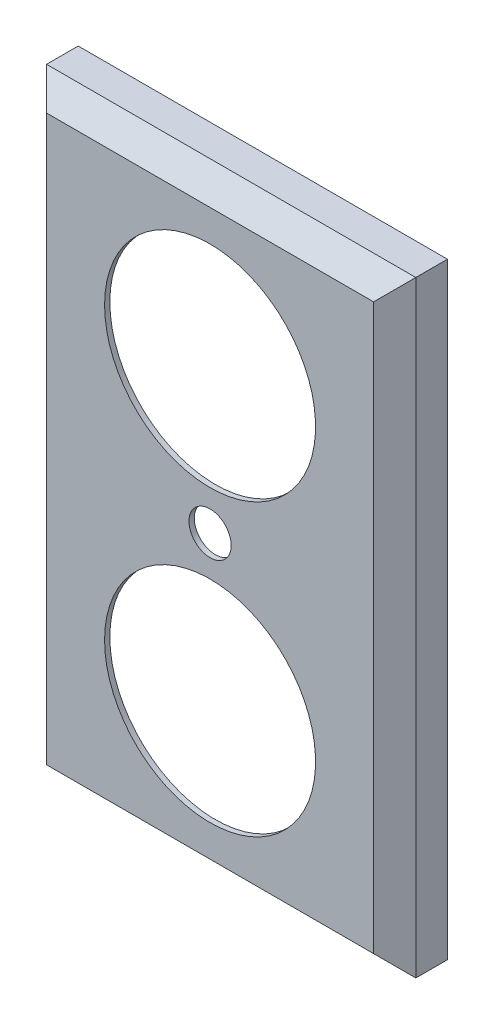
ISO-10303-21;
HEADER;
FILE_DESCRIPTION(('STEP AP214'),'2;1');
FILE_NAME('part.step','',(''),(''),'','','');
FILE_SCHEMA(('AUTOMOTIVE_DESIGN { 1 0 10303 214 1 1 1 1 }'));
ENDSEC;
DATA;
#1=APPLICATION_CONTEXT('core data for automotive mechanical design processes');
#2=APPLICATION_PROTOCOL_DEFINITION('international standard','automotive_design',2000,#1);
#3=PRODUCT_CONTEXT('',#1,'mechanical');
#4=PRODUCT('Part','Part','',(#3));
#5=PRODUCT_RELATED_PRODUCT_CATEGORY('part','',(#4));
#6=PRODUCT_DEFINITION_FORMATION('','',#4);
#7=PRODUCT_DEFINITION_CONTEXT('part definition',#1,'design');
#8=PRODUCT_DEFINITION('design','',#6,#7);
#9=PRODUCT_DEFINITION_SHAPE('','',#8);
#10=(LENGTH_UNIT() NAMED_UNIT(*) SI_UNIT(.MILLI.,.METRE.));
#11=(NAMED_UNIT(*) PLANE_ANGLE_UNIT() SI_UNIT($,.RADIAN.));
#12=(NAMED_UNIT(*) SI_UNIT($,.STERADIAN.) SOLID_ANGLE_UNIT());
#13=UNCERTAINTY_MEASURE_WITH_UNIT(LENGTH_MEASURE(1.E-05),#10,'distance_accuracy_value','');
#14=(GEOMETRIC_REPRESENTATION_CONTEXT(3) GLOBAL_UNCERTAINTY_ASSIGNED_CONTEXT((#13)) GLOBAL_UNIT_ASSIGNED_CONTEXT((#10,
#11,#12)) REPRESENTATION_CONTEXT('',''));
#15=CARTESIAN_POINT('',(0.,0.,0.));
#16=DIRECTION('',(0.,0.,1.));
#17=DIRECTION('',(1.,0.,0.));
#18=AXIS2_PLACEMENT_3D('',#15,#16,#17);
#19=CARTESIAN_POINT('',(0.,115.,0.));
#20=DIRECTION('',(0.,0.,-1.));
#21=DIRECTION('',(-1.,0.,0.));
#22=AXIS2_PLACEMENT_3D('',#19,#20,#21);
#23=PLANE('',#22);
#24=DIRECTION('',(0.,-1.,0.));
#25=VECTOR('',#24,1.);
#26=CARTESIAN_POINT('',(0.,0.,0.));
#27=LINE('',#26,#25);
#28=CARTESIAN_POINT('',(0.,115.,0.));
#29=VERTEX_POINT('',#28);
#30=CARTESIAN_POINT('',(0.,0.,0.));
#31=VERTEX_POINT('',#30);
#32=EDGE_CURVE('E176',#29,#31,#27,.T.);
#33=ORIENTED_EDGE('',*,*,#32,.F.);
#34=DIRECTION('',(-1.,0.,0.));
#35=VECTOR('',#34,1.);
#36=CARTESIAN_POINT('',(0.,115.,0.));
#37=LINE('',#36,#35);
#38=CARTESIAN_POINT('',(70.,115.,0.));
#39=VERTEX_POINT('',#38);
#40=EDGE_CURVE('E186',#39,#29,#37,.T.);
#41=ORIENTED_EDGE('',*,*,#40,.F.);
#42=DIRECTION('',(0.,1.,0.));
#43=VECTOR('',#42,1.);
#44=CARTESIAN_POINT('',(70.,0.,0.));
#45=LINE('',#44,#43);
#46=CARTESIAN_POINT('',(70.,0.,0.));
#47=VERTEX_POINT('',#46);
#48=EDGE_CURVE('E183',#47,#39,#45,.T.);
#49=ORIENTED_EDGE('',*,*,#48,.F.);
#50=DIRECTION('',(1.,0.,0.));
#51=VECTOR('',#50,1.);
#52=CARTESIAN_POINT('',(0.,0.,0.));
#53=LINE('',#52,#51);
#54=EDGE_CURVE('E179',#31,#47,#53,.T.);
#55=ORIENTED_EDGE('',*,*,#54,.F.);
#56=EDGE_LOOP('',(#33,#41,#49,#55));
#57=FACE_BOUND('',#56,.T.);
#58=DIRECTION('',(-1.,0.,0.));
#59=VECTOR('',#58,1.);
#60=CARTESIAN_POINT('',(0.,114.,0.));
#61=LINE('',#60,#59);
#62=CARTESIAN_POINT('',(69.,114.,0.));
#63=VERTEX_POINT('',#62);
#64=CARTESIAN_POINT('',(1.,114.,0.));
#65=VERTEX_POINT('',#64);
#66=EDGE_CURVE('E145',#63,#65,#61,.T.);
#67=ORIENTED_EDGE('',*,*,#66,.T.);
#68=DIRECTION('',(0.,-1.,0.));
#69=VECTOR('',#68,1.);
#70=CARTESIAN_POINT('',(1.,115.,0.));
#71=LINE('',#70,#69);
#72=CARTESIAN_POINT('',(1.,1.,0.));
#73=VERTEX_POINT('',#72);
#74=EDGE_CURVE('E140',#65,#73,#71,.T.);
#75=ORIENTED_EDGE('',*,*,#74,.T.);
#76=DIRECTION('',(1.,0.,0.));
#77=VECTOR('',#76,1.);
#78=CARTESIAN_POINT('',(0.,1.,0.));
#79=LINE('',#78,#77);
#80=CARTESIAN_POINT('',(69.,1.,0.));
#81=VERTEX_POINT('',#80);
#82=EDGE_CURVE('E170',#73,#81,#79,.T.);
#83=ORIENTED_EDGE('',*,*,#82,.T.);
#84=DIRECTION('',(0.,1.,0.));
#85=VECTOR('',#84,1.);
#86=CARTESIAN_POINT('',(69.,115.,0.));
#87=LINE('',#86,#85);
#88=EDGE_CURVE('E49',#81,#63,#87,.T.);
#89=ORIENTED_EDGE('',*,*,#88,.T.);
#90=EDGE_LOOP('',(#67,#75,#83,#89));
#91=FACE_BOUND('',#90,.T.);
#92=ADVANCED_FACE('F32',(#57,#91),#23,.T.);
#93=CARTESIAN_POINT('',(0.,0.,10.));
#94=DIRECTION('',(1.,0.,0.));
#95=DIRECTION('',(0.,0.,-1.));
#96=AXIS2_PLACEMENT_3D('',#93,#94,#95);
#97=PLANE('',#96);
#98=DIRECTION('',(0.,0.,-1.));
#99=VECTOR('',#98,1.);
#100=CARTESIAN_POINT('',(0.,0.,10.));
#101=LINE('',#100,#99);
#102=CARTESIAN_POINT('',(0.,0.,5.99999999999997));
#103=VERTEX_POINT('',#102);
#104=EDGE_CURVE('E195',#103,#31,#101,.T.);
#105=ORIENTED_EDGE('',*,*,#104,.F.);
#106=DIRECTION('',(0.,1.,0.));
#107=VECTOR('',#106,1.);
#108=CARTESIAN_POINT('',(0.,0.,5.99999999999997));
#109=LINE('',#108,#107);
#110=CARTESIAN_POINT('',(0.,115.,5.99999999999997));
#111=VERTEX_POINT('',#110);
#112=EDGE_CURVE('E11',#103,#111,#109,.T.);
#113=ORIENTED_EDGE('',*,*,#112,.T.);
#114=DIRECTION('',(0.,0.,-1.));
#115=VECTOR('',#114,1.);
#116=CARTESIAN_POINT('',(0.,115.,10.));
#117=LINE('',#116,#115);
#118=EDGE_CURVE('E189',#111,#29,#117,.T.);
#119=ORIENTED_EDGE('',*,*,#118,.T.);
#120=ORIENTED_EDGE('',*,*,#32,.T.);
#121=EDGE_LOOP('',(#105,#113,#119,#120));
#122=FACE_BOUND('',#121,.T.);
#123=ADVANCED_FACE('F271',(#122),#97,.F.);
#124=CARTESIAN_POINT('',(0.,0.,10.));
#125=DIRECTION('',(0.,1.,0.));
#126=DIRECTION('',(0.,0.,1.));
#127=AXIS2_PLACEMENT_3D('',#124,#125,#126);
#128=PLANE('',#127);
#129=DIRECTION('',(0.,0.,-1.));
#130=VECTOR('',#129,1.);
#131=CARTESIAN_POINT('',(70.,0.,10.));
#132=LINE('',#131,#130);
#133=CARTESIAN_POINT('',(70.,0.,5.99999999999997));
#134=VERTEX_POINT('',#133);
#135=EDGE_CURVE('E193',#134,#47,#132,.T.);
#136=ORIENTED_EDGE('',*,*,#135,.F.);
#137=DIRECTION('',(-1.,0.,0.));
#138=VECTOR('',#137,1.);
#139=CARTESIAN_POINT('',(0.,0.,5.99999999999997));
#140=LINE('',#139,#138);
#141=EDGE_CURVE('E41',#134,#103,#140,.T.);
#142=ORIENTED_EDGE('',*,*,#141,.T.);
#143=ORIENTED_EDGE('',*,*,#104,.T.);
#144=ORIENTED_EDGE('',*,*,#54,.T.);
#145=EDGE_LOOP('',(#136,#142,#143,#144));
#146=FACE_BOUND('',#145,.T.);
#147=ADVANCED_FACE('F277',(#146),#128,.F.);
#148=CARTESIAN_POINT('',(70.,0.,10.));
#149=DIRECTION('',(-1.,0.,0.));
#150=DIRECTION('',(0.,0.,1.));
#151=AXIS2_PLACEMENT_3D('',#148,#149,#150);
#152=PLANE('',#151);
#153=DIRECTION('',(0.,0.,-1.));
#154=VECTOR('',#153,1.);
#155=CARTESIAN_POINT('',(70.,115.,10.));
#156=LINE('',#155,#154);
#157=CARTESIAN_POINT('',(70.,115.,5.99999999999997));
#158=VERTEX_POINT('',#157);
#159=EDGE_CURVE('E191',#158,#39,#156,.T.);
#160=ORIENTED_EDGE('',*,*,#159,.F.);
#161=DIRECTION('',(0.,-1.,0.));
#162=VECTOR('',#161,1.);
#163=CARTESIAN_POINT('',(70.,0.,5.99999999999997));
#164=LINE('',#163,#162);
#165=EDGE_CURVE('E209',#158,#134,#164,.T.);
#166=ORIENTED_EDGE('',*,*,#165,.T.);
#167=ORIENTED_EDGE('',*,*,#135,.T.);
#168=ORIENTED_EDGE('',*,*,#48,.T.);
#169=EDGE_LOOP('',(#160,#166,#167,#168));
#170=FACE_BOUND('',#169,.T.);
#171=ADVANCED_FACE('F289',(#170),#152,.F.);
#172=CARTESIAN_POINT('',(0.,115.,10.));
#173=DIRECTION('',(0.,-1.,0.));
#174=DIRECTION('',(0.,0.,-1.));
#175=AXIS2_PLACEMENT_3D('',#172,#173,#174);
#176=PLANE('',#175);
#177=ORIENTED_EDGE('',*,*,#118,.F.);
#178=DIRECTION('',(1.,0.,0.));
#179=VECTOR('',#178,1.);
#180=CARTESIAN_POINT('',(0.,115.,5.99999999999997));
#181=LINE('',#180,#179);
#182=EDGE_CURVE('E206',#111,#158,#181,.T.);
#183=ORIENTED_EDGE('',*,*,#182,.T.);
#184=ORIENTED_EDGE('',*,*,#159,.T.);
#185=ORIENTED_EDGE('',*,*,#40,.T.);
#186=EDGE_LOOP('',(#177,#183,#184,#185));
#187=FACE_BOUND('',#186,.T.);
#188=ADVANCED_FACE('F286',(#187),#176,.F.);
#189=CARTESIAN_POINT('',(0.,115.,10.));
#190=DIRECTION('',(0.,0.,-1.));
#191=DIRECTION('',(-1.,0.,0.));
#192=AXIS2_PLACEMENT_3D('',#189,#190,#191);
#193=PLANE('',#192);
#194=CARTESIAN_POINT('',(35.,57.5,10.));
#195=DIRECTION('',(0.,0.,1.));
#196=DIRECTION('',(1.,0.,0.));
#197=AXIS2_PLACEMENT_3D('',#194,#195,#196);
#198=CIRCLE('',#197,4.00000000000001);
#199=CARTESIAN_POINT('',(39.,57.5,10.));
#200=VERTEX_POINT('',#199);
#201=EDGE_CURVE('E231',#200,#200,#198,.T.);
#202=ORIENTED_EDGE('',*,*,#201,.F.);
#203=EDGE_LOOP('',(#202));
#204=FACE_BOUND('',#203,.T.);
#205=CARTESIAN_POINT('',(35.,30.,10.));
#206=DIRECTION('',(0.,0.,-1.));
#207=DIRECTION('',(-1.,0.,0.));
#208=AXIS2_PLACEMENT_3D('',#205,#206,#207);
#209=CIRCLE('',#208,20.);
#210=CARTESIAN_POINT('',(15.,30.,10.));
#211=VERTEX_POINT('',#210);
#212=EDGE_CURVE('E221',#211,#211,#209,.T.);
#213=ORIENTED_EDGE('',*,*,#212,.T.);
#214=EDGE_LOOP('',(#213));
#215=FACE_BOUND('',#214,.T.);
#216=CARTESIAN_POINT('',(35.,85.,10.));
#217=DIRECTION('',(0.,0.,-1.));
#218=DIRECTION('',(-1.,0.,0.));
#219=AXIS2_PLACEMENT_3D('',#216,#217,#218);
#220=CIRCLE('',#219,20.);
#221=CARTESIAN_POINT('',(15.,85.,10.));
#222=VERTEX_POINT('',#221);
#223=EDGE_CURVE('E164',#222,#222,#220,.T.);
#224=ORIENTED_EDGE('',*,*,#223,.T.);
#225=EDGE_LOOP('',(#224));
#226=FACE_BOUND('',#225,.T.);
#227=DIRECTION('',(0.,1.,0.));
#228=VECTOR('',#227,1.);
#229=CARTESIAN_POINT('',(65.9999999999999,115.,10.));
#230=LINE('',#229,#228);
#231=CARTESIAN_POINT('',(65.9999999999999,4.00000000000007,10.));
#232=VERTEX_POINT('',#231);
#233=CARTESIAN_POINT('',(65.9999999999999,111.,10.));
#234=VERTEX_POINT('',#233);
#235=EDGE_CURVE('E201',#232,#234,#230,.T.);
#236=ORIENTED_EDGE('',*,*,#235,.T.);
#237=DIRECTION('',(-1.,0.,0.));
#238=VECTOR('',#237,1.);
#239=CARTESIAN_POINT('',(0.,111.,10.));
#240=LINE('',#239,#238);
#241=CARTESIAN_POINT('',(4.00000000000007,111.,10.));
#242=VERTEX_POINT('',#241);
#243=EDGE_CURVE('E203',#234,#242,#240,.T.);
#244=ORIENTED_EDGE('',*,*,#243,.T.);
#245=DIRECTION('',(0.,-1.,0.));
#246=VECTOR('',#245,1.);
#247=CARTESIAN_POINT('',(4.00000000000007,115.,10.));
#248=LINE('',#247,#246);
#249=CARTESIAN_POINT('',(4.00000000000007,4.00000000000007,10.));
#250=VERTEX_POINT('',#249);
#251=EDGE_CURVE('E197',#242,#250,#248,.T.);
#252=ORIENTED_EDGE('',*,*,#251,.T.);
#253=DIRECTION('',(1.,0.,0.));
#254=VECTOR('',#253,1.);
#255=CARTESIAN_POINT('',(0.,4.00000000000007,10.));
#256=LINE('',#255,#254);
#257=EDGE_CURVE('E199',#250,#232,#256,.T.);
#258=ORIENTED_EDGE('',*,*,#257,.T.);
#259=EDGE_LOOP('',(#236,#244,#252,#258));
#260=FACE_BOUND('',#259,.T.);
#261=ADVANCED_FACE('F284',(#204,#215,#226,#260),#193,.F.);
#262=CARTESIAN_POINT('',(0.,4.00000000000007,10.));
#263=DIRECTION('',(0.,0.707106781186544,-0.707106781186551));
#264=DIRECTION('',(0.,0.707106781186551,0.707106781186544));
#265=AXIS2_PLACEMENT_3D('',#262,#263,#264);
#266=PLANE('',#265);
#267=DIRECTION('',(0.577350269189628,0.577350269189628,0.577350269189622));
#268=VECTOR('',#267,1.);
#269=CARTESIAN_POINT('',(41.0000000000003,41.0000000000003,46.9999999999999));
#270=LINE('',#269,#268);
#271=EDGE_CURVE('E215',#103,#250,#270,.T.);
#272=ORIENTED_EDGE('',*,*,#271,.F.);
#273=ORIENTED_EDGE('',*,*,#141,.F.);
#274=DIRECTION('',(-0.577350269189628,0.577350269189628,0.577350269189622));
#275=VECTOR('',#274,1.);
#276=CARTESIAN_POINT('',(43.9999999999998,26.0000000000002,31.9999999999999));
#277=LINE('',#276,#275);
#278=EDGE_CURVE('E180',#232,#134,#277,.F.);
#279=ORIENTED_EDGE('',*,*,#278,.F.);
#280=ORIENTED_EDGE('',*,*,#257,.F.);
#281=EDGE_LOOP('',(#272,#273,#279,#280));
#282=FACE_BOUND('',#281,.T.);
#283=ADVANCED_FACE('F34',(#282),#266,.F.);
#284=CARTESIAN_POINT('',(65.9999999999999,115.,10.));
#285=DIRECTION('',(-0.707106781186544,0.,-0.707106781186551));
#286=DIRECTION('',(-0.707106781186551,0.,0.707106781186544));
#287=AXIS2_PLACEMENT_3D('',#284,#285,#286);
#288=PLANE('',#287);
#289=ORIENTED_EDGE('',*,*,#278,.T.);
#290=ORIENTED_EDGE('',*,*,#165,.F.);
#291=DIRECTION('',(-0.577350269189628,-0.577350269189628,0.577350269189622));
#292=VECTOR('',#291,1.);
#293=CARTESIAN_POINT('',(67.3333333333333,112.333333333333,8.66666666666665));
#294=LINE('',#293,#292);
#295=EDGE_CURVE('E213',#234,#158,#294,.F.);
#296=ORIENTED_EDGE('',*,*,#295,.F.);
#297=ORIENTED_EDGE('',*,*,#235,.F.);
#298=EDGE_LOOP('',(#289,#290,#296,#297));
#299=FACE_BOUND('',#298,.T.);
#300=ADVANCED_FACE('F302',(#299),#288,.F.);
#301=CARTESIAN_POINT('',(4.00000000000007,115.,10.));
#302=DIRECTION('',(0.707106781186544,0.,-0.707106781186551));
#303=DIRECTION('',(-0.707106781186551,0.,-0.707106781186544));
#304=AXIS2_PLACEMENT_3D('',#301,#302,#303);
#305=PLANE('',#304);
#306=ORIENTED_EDGE('',*,*,#271,.T.);
#307=ORIENTED_EDGE('',*,*,#251,.F.);
#308=DIRECTION('',(-0.577350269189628,0.577350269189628,-0.577350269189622));
#309=VECTOR('',#308,1.);
#310=CARTESIAN_POINT('',(2.6666666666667,112.333333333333,8.66666666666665));
#311=LINE('',#310,#309);
#312=EDGE_CURVE('E132',#111,#242,#311,.F.);
#313=ORIENTED_EDGE('',*,*,#312,.F.);
#314=ORIENTED_EDGE('',*,*,#112,.F.);
#315=EDGE_LOOP('',(#306,#307,#313,#314));
#316=FACE_BOUND('',#315,.T.);
#317=ADVANCED_FACE('F299',(#316),#305,.F.);
#318=CARTESIAN_POINT('',(0.,111.,10.));
#319=DIRECTION('',(0.,-0.707106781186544,-0.707106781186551));
#320=DIRECTION('',(0.,0.707106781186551,-0.707106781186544));
#321=AXIS2_PLACEMENT_3D('',#318,#319,#320);
#322=PLANE('',#321);
#323=ORIENTED_EDGE('',*,*,#295,.T.);
#324=ORIENTED_EDGE('',*,*,#182,.F.);
#325=ORIENTED_EDGE('',*,*,#312,.T.);
#326=ORIENTED_EDGE('',*,*,#243,.F.);
#327=EDGE_LOOP('',(#323,#324,#325,#326));
#328=FACE_BOUND('',#327,.T.);
#329=ADVANCED_FACE('F296',(#328),#322,.F.);
#330=CARTESIAN_POINT('',(1.,0.,10.));
#331=DIRECTION('',(1.,0.,0.));
#332=DIRECTION('',(0.,0.,-1.));
#333=AXIS2_PLACEMENT_3D('',#330,#331,#332);
#334=PLANE('',#333);
#335=DIRECTION('',(0.,0.,-1.));
#336=VECTOR('',#335,1.);
#337=CARTESIAN_POINT('',(1.,1.,10.));
#338=LINE('',#337,#336);
#339=CARTESIAN_POINT('',(0.999999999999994,1.,5.58578643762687));
#340=VERTEX_POINT('',#339);
#341=EDGE_CURVE('E234',#340,#73,#338,.T.);
#342=ORIENTED_EDGE('',*,*,#341,.T.);
#343=ORIENTED_EDGE('',*,*,#74,.F.);
#344=DIRECTION('',(0.,0.,-1.));
#345=VECTOR('',#344,1.);
#346=CARTESIAN_POINT('',(1.,114.,10.));
#347=LINE('',#346,#345);
#348=CARTESIAN_POINT('',(1.,114.,5.58578643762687));
#349=VERTEX_POINT('',#348);
#350=EDGE_CURVE('E136',#349,#65,#347,.T.);
#351=ORIENTED_EDGE('',*,*,#350,.F.);
#352=DIRECTION('',(0.,-1.,0.));
#353=VECTOR('',#352,1.);
#354=CARTESIAN_POINT('',(1.,115.,5.58578643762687));
#355=LINE('',#354,#353);
#356=EDGE_CURVE('E123',#340,#349,#355,.F.);
#357=ORIENTED_EDGE('',*,*,#356,.F.);
#358=EDGE_LOOP('',(#342,#343,#351,#357));
#359=FACE_BOUND('',#358,.T.);
#360=ADVANCED_FACE('F138',(#359),#334,.T.);
#361=CARTESIAN_POINT('',(0.,1.,10.));
#362=DIRECTION('',(0.,1.,0.));
#363=DIRECTION('',(0.,0.,1.));
#364=AXIS2_PLACEMENT_3D('',#361,#362,#363);
#365=PLANE('',#364);
#366=DIRECTION('',(0.,0.,-1.));
#367=VECTOR('',#366,1.);
#368=CARTESIAN_POINT('',(69.,1.,10.));
#369=LINE('',#368,#367);
#370=CARTESIAN_POINT('',(69.,0.999999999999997,5.58578643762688));
#371=VERTEX_POINT('',#370);
#372=EDGE_CURVE('E236',#371,#81,#369,.T.);
#373=ORIENTED_EDGE('',*,*,#372,.T.);
#374=ORIENTED_EDGE('',*,*,#82,.F.);
#375=ORIENTED_EDGE('',*,*,#341,.F.);
#376=DIRECTION('',(1.,0.,0.));
#377=VECTOR('',#376,1.);
#378=CARTESIAN_POINT('',(0.,1.,5.58578643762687));
#379=LINE('',#378,#377);
#380=EDGE_CURVE('E133',#371,#340,#379,.F.);
#381=ORIENTED_EDGE('',*,*,#380,.F.);
#382=EDGE_LOOP('',(#373,#374,#375,#381));
#383=FACE_BOUND('',#382,.T.);
#384=ADVANCED_FACE('F349',(#383),#365,.T.);
#385=CARTESIAN_POINT('',(69.,0.,10.));
#386=DIRECTION('',(-1.,0.,0.));
#387=DIRECTION('',(0.,0.,1.));
#388=AXIS2_PLACEMENT_3D('',#385,#386,#387);
#389=PLANE('',#388);
#390=DIRECTION('',(0.,0.,-1.));
#391=VECTOR('',#390,1.);
#392=CARTESIAN_POINT('',(69.,114.,10.));
#393=LINE('',#392,#391);
#394=CARTESIAN_POINT('',(69.,114.,5.58578643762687));
#395=VERTEX_POINT('',#394);
#396=EDGE_CURVE('E144',#395,#63,#393,.T.);
#397=ORIENTED_EDGE('',*,*,#396,.T.);
#398=ORIENTED_EDGE('',*,*,#88,.F.);
#399=ORIENTED_EDGE('',*,*,#372,.F.);
#400=DIRECTION('',(0.,1.,0.));
#401=VECTOR('',#400,1.);
#402=CARTESIAN_POINT('',(69.,115.,5.58578643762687));
#403=LINE('',#402,#401);
#404=EDGE_CURVE('E153',#395,#371,#403,.F.);
#405=ORIENTED_EDGE('',*,*,#404,.F.);
#406=EDGE_LOOP('',(#397,#398,#399,#405));
#407=FACE_BOUND('',#406,.T.);
#408=ADVANCED_FACE('F266',(#407),#389,.T.);
#409=CARTESIAN_POINT('',(0.,114.,10.));
#410=DIRECTION('',(0.,-1.,0.));
#411=DIRECTION('',(0.,0.,-1.));
#412=AXIS2_PLACEMENT_3D('',#409,#410,#411);
#413=PLANE('',#412);
#414=ORIENTED_EDGE('',*,*,#350,.T.);
#415=ORIENTED_EDGE('',*,*,#66,.F.);
#416=ORIENTED_EDGE('',*,*,#396,.F.);
#417=DIRECTION('',(-1.,0.,0.));
#418=VECTOR('',#417,1.);
#419=CARTESIAN_POINT('',(0.,114.,5.58578643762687));
#420=LINE('',#419,#418);
#421=EDGE_CURVE('E149',#349,#395,#420,.F.);
#422=ORIENTED_EDGE('',*,*,#421,.F.);
#423=EDGE_LOOP('',(#414,#415,#416,#422));
#424=FACE_BOUND('',#423,.T.);
#425=ADVANCED_FACE('F150',(#424),#413,.T.);
#426=CARTESIAN_POINT('',(0.,115.,9.));
#427=DIRECTION('',(0.,0.,-1.));
#428=DIRECTION('',(-1.,0.,0.));
#429=AXIS2_PLACEMENT_3D('',#426,#427,#428);
#430=PLANE('',#429);
#431=CARTESIAN_POINT('',(35.,57.5,9.));
#432=DIRECTION('',(0.,0.,-1.));
#433=DIRECTION('',(-1.,0.,0.));
#434=AXIS2_PLACEMENT_3D('',#431,#432,#433);
#435=CIRCLE('',#434,4.00000000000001);
#436=CARTESIAN_POINT('',(31.,57.5,9.));
#437=VERTEX_POINT('',#436);
#438=EDGE_CURVE('E36',#437,#437,#435,.T.);
#439=ORIENTED_EDGE('',*,*,#438,.F.);
#440=EDGE_LOOP('',(#439));
#441=FACE_BOUND('',#440,.T.);
#442=CARTESIAN_POINT('',(35.,30.,9.));
#443=DIRECTION('',(0.,0.,-1.));
#444=DIRECTION('',(-1.,0.,0.));
#445=AXIS2_PLACEMENT_3D('',#442,#443,#444);
#446=CIRCLE('',#445,20.);
#447=CARTESIAN_POINT('',(15.,30.,9.));
#448=VERTEX_POINT('',#447);
#449=EDGE_CURVE('E219',#448,#448,#446,.T.);
#450=ORIENTED_EDGE('',*,*,#449,.F.);
#451=EDGE_LOOP('',(#450));
#452=FACE_BOUND('',#451,.T.);
#453=CARTESIAN_POINT('',(35.,85.,9.));
#454=DIRECTION('',(0.,0.,-1.));
#455=DIRECTION('',(-1.,0.,0.));
#456=AXIS2_PLACEMENT_3D('',#453,#454,#455);
#457=CIRCLE('',#456,20.);
#458=CARTESIAN_POINT('',(15.,85.,9.));
#459=VERTEX_POINT('',#458);
#460=EDGE_CURVE('E160',#459,#459,#457,.T.);
#461=ORIENTED_EDGE('',*,*,#460,.F.);
#462=EDGE_LOOP('',(#461));
#463=FACE_BOUND('',#462,.T.);
#464=DIRECTION('',(0.,-1.,0.));
#465=VECTOR('',#464,1.);
#466=CARTESIAN_POINT('',(65.5857864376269,115.,9.));
#467=LINE('',#466,#465);
#468=CARTESIAN_POINT('',(65.5857864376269,4.41421356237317,9.));
#469=VERTEX_POINT('',#468);
#470=CARTESIAN_POINT('',(65.5857864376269,110.585786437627,9.));
#471=VERTEX_POINT('',#470);
#472=EDGE_CURVE('E244',#469,#471,#467,.F.);
#473=ORIENTED_EDGE('',*,*,#472,.F.);
#474=DIRECTION('',(-1.,0.,0.));
#475=VECTOR('',#474,1.);
#476=CARTESIAN_POINT('',(0.,4.41421356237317,9.));
#477=LINE('',#476,#475);
#478=CARTESIAN_POINT('',(4.41421356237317,4.41421356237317,9.));
#479=VERTEX_POINT('',#478);
#480=EDGE_CURVE('E246',#479,#469,#477,.F.);
#481=ORIENTED_EDGE('',*,*,#480,.F.);
#482=DIRECTION('',(0.,1.,0.));
#483=VECTOR('',#482,1.);
#484=CARTESIAN_POINT('',(4.41421356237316,115.,9.));
#485=LINE('',#484,#483);
#486=CARTESIAN_POINT('',(4.41421356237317,110.585786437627,9.));
#487=VERTEX_POINT('',#486);
#488=EDGE_CURVE('E235',#487,#479,#485,.F.);
#489=ORIENTED_EDGE('',*,*,#488,.F.);
#490=DIRECTION('',(1.,0.,0.));
#491=VECTOR('',#490,1.);
#492=CARTESIAN_POINT('',(0.,110.585786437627,9.));
#493=LINE('',#492,#491);
#494=EDGE_CURVE('E154',#471,#487,#493,.F.);
#495=ORIENTED_EDGE('',*,*,#494,.F.);
#496=EDGE_LOOP('',(#473,#481,#489,#495));
#497=FACE_BOUND('',#496,.T.);
#498=ADVANCED_FACE('F257',(#441,#452,#463,#497),#430,.T.);
#499=CARTESIAN_POINT('',(0.,4.70710678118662,9.29289321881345));
#500=DIRECTION('',(0.,0.707106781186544,-0.707106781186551));
#501=DIRECTION('',(0.,0.707106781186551,0.707106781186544));
#502=AXIS2_PLACEMENT_3D('',#499,#500,#501);
#503=PLANE('',#502);
#504=DIRECTION('',(0.577350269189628,0.577350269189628,0.577350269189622));
#505=VECTOR('',#504,1.);
#506=CARTESIAN_POINT('',(41.4714045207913,41.4714045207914,46.0571909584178));
#507=LINE('',#506,#505);
#508=EDGE_CURVE('E130',#340,#479,#507,.T.);
#509=ORIENTED_EDGE('',*,*,#508,.T.);
#510=ORIENTED_EDGE('',*,*,#480,.T.);
#511=DIRECTION('',(0.577350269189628,-0.577350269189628,-0.577350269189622));
#512=VECTOR('',#511,1.);
#513=CARTESIAN_POINT('',(28.5285954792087,41.4714045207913,46.0571909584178));
#514=LINE('',#513,#512);
#515=EDGE_CURVE('E171',#469,#371,#514,.T.);
#516=ORIENTED_EDGE('',*,*,#515,.T.);
#517=ORIENTED_EDGE('',*,*,#380,.T.);
#518=EDGE_LOOP('',(#509,#510,#516,#517));
#519=FACE_BOUND('',#518,.T.);
#520=ADVANCED_FACE('F251',(#519),#503,.T.);
#521=CARTESIAN_POINT('',(65.2928932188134,115.,9.29289321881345));
#522=DIRECTION('',(-0.707106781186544,0.,-0.707106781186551));
#523=DIRECTION('',(-0.707106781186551,0.,0.707106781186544));
#524=AXIS2_PLACEMENT_3D('',#521,#522,#523);
#525=PLANE('',#524);
#526=ORIENTED_EDGE('',*,*,#515,.F.);
#527=ORIENTED_EDGE('',*,*,#472,.T.);
#528=DIRECTION('',(0.577350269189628,0.577350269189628,-0.577350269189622));
#529=VECTOR('',#528,1.);
#530=CARTESIAN_POINT('',(43.5285954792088,88.5285954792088,31.0571909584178));
#531=LINE('',#530,#529);
#532=EDGE_CURVE('E159',#471,#395,#531,.T.);
#533=ORIENTED_EDGE('',*,*,#532,.T.);
#534=ORIENTED_EDGE('',*,*,#404,.T.);
#535=EDGE_LOOP('',(#526,#527,#533,#534));
#536=FACE_BOUND('',#535,.T.);
#537=ADVANCED_FACE('F255',(#536),#525,.T.);
#538=CARTESIAN_POINT('',(4.70710678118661,115.,9.29289321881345));
#539=DIRECTION('',(0.707106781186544,0.,-0.707106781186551));
#540=DIRECTION('',(-0.707106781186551,0.,-0.707106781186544));
#541=AXIS2_PLACEMENT_3D('',#538,#539,#540);
#542=PLANE('',#541);
#543=ORIENTED_EDGE('',*,*,#508,.F.);
#544=ORIENTED_EDGE('',*,*,#356,.T.);
#545=DIRECTION('',(0.577350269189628,-0.577350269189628,0.577350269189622));
#546=VECTOR('',#545,1.);
#547=CARTESIAN_POINT('',(3.13807118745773,111.861928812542,7.72385762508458));
#548=LINE('',#547,#546);
#549=EDGE_CURVE('E127',#349,#487,#548,.T.);
#550=ORIENTED_EDGE('',*,*,#549,.T.);
#551=ORIENTED_EDGE('',*,*,#488,.T.);
#552=EDGE_LOOP('',(#543,#544,#550,#551));
#553=FACE_BOUND('',#552,.T.);
#554=ADVANCED_FACE('F125',(#553),#542,.T.);
#555=CARTESIAN_POINT('',(0.,110.292893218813,9.29289321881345));
#556=DIRECTION('',(0.,-0.707106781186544,-0.707106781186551));
#557=DIRECTION('',(0.,0.707106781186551,-0.707106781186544));
#558=AXIS2_PLACEMENT_3D('',#555,#556,#557);
#559=PLANE('',#558);
#560=ORIENTED_EDGE('',*,*,#532,.F.);
#561=ORIENTED_EDGE('',*,*,#494,.T.);
#562=ORIENTED_EDGE('',*,*,#549,.F.);
#563=ORIENTED_EDGE('',*,*,#421,.T.);
#564=EDGE_LOOP('',(#560,#561,#562,#563));
#565=FACE_BOUND('',#564,.T.);
#566=ADVANCED_FACE('F157',(#565),#559,.T.);
#567=CARTESIAN_POINT('',(35.,85.,10.));
#568=DIRECTION('',(0.,0.,-1.));
#569=DIRECTION('',(-1.,0.,0.));
#570=AXIS2_PLACEMENT_3D('',#567,#568,#569);
#571=CYLINDRICAL_SURFACE('',#570,20.);
#572=ORIENTED_EDGE('',*,*,#460,.T.);
#573=EDGE_LOOP('',(#572));
#574=FACE_BOUND('',#573,.T.);
#575=ORIENTED_EDGE('',*,*,#223,.F.);
#576=EDGE_LOOP('',(#575));
#577=FACE_BOUND('',#576,.T.);
#578=ADVANCED_FACE('F334',(#574,#577),#571,.F.);
#579=CARTESIAN_POINT('',(35.,30.,10.));
#580=DIRECTION('',(0.,0.,-1.));
#581=DIRECTION('',(-1.,0.,0.));
#582=AXIS2_PLACEMENT_3D('',#579,#580,#581);
#583=CYLINDRICAL_SURFACE('',#582,20.);
#584=ORIENTED_EDGE('',*,*,#449,.T.);
#585=EDGE_LOOP('',(#584));
#586=FACE_BOUND('',#585,.T.);
#587=ORIENTED_EDGE('',*,*,#212,.F.);
#588=EDGE_LOOP('',(#587));
#589=FACE_BOUND('',#588,.T.);
#590=ADVANCED_FACE('F336',(#586,#589),#583,.F.);
#591=CARTESIAN_POINT('',(35.,57.5,0.));
#592=DIRECTION('',(0.,0.,1.));
#593=DIRECTION('',(1.,0.,0.));
#594=AXIS2_PLACEMENT_3D('',#591,#592,#593);
#595=CYLINDRICAL_SURFACE('',#594,4.00000000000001);
#596=ORIENTED_EDGE('',*,*,#438,.T.);
#597=EDGE_LOOP('',(#596));
#598=FACE_BOUND('',#597,.T.);
#599=ORIENTED_EDGE('',*,*,#201,.T.);
#600=EDGE_LOOP('',(#599));
#601=FACE_BOUND('',#600,.T.);
#602=ADVANCED_FACE('F343',(#598,#601),#595,.F.);
#603=CLOSED_SHELL('',(#92,#123,#147,#171,#188,#261,#283,#300,#317,#329,#360,#384,#408,#425,#498,
#520,#537,#554,#566,#578,#590,#602));
#604=MANIFOLD_SOLID_BREP('B2',#603);
#605=ADVANCED_BREP_SHAPE_REPRESENTATION('',(#18,#604),#14);
#606=SHAPE_DEFINITION_REPRESENTATION(#9,#605);
ENDSEC;
END-ISO-10303-21;
